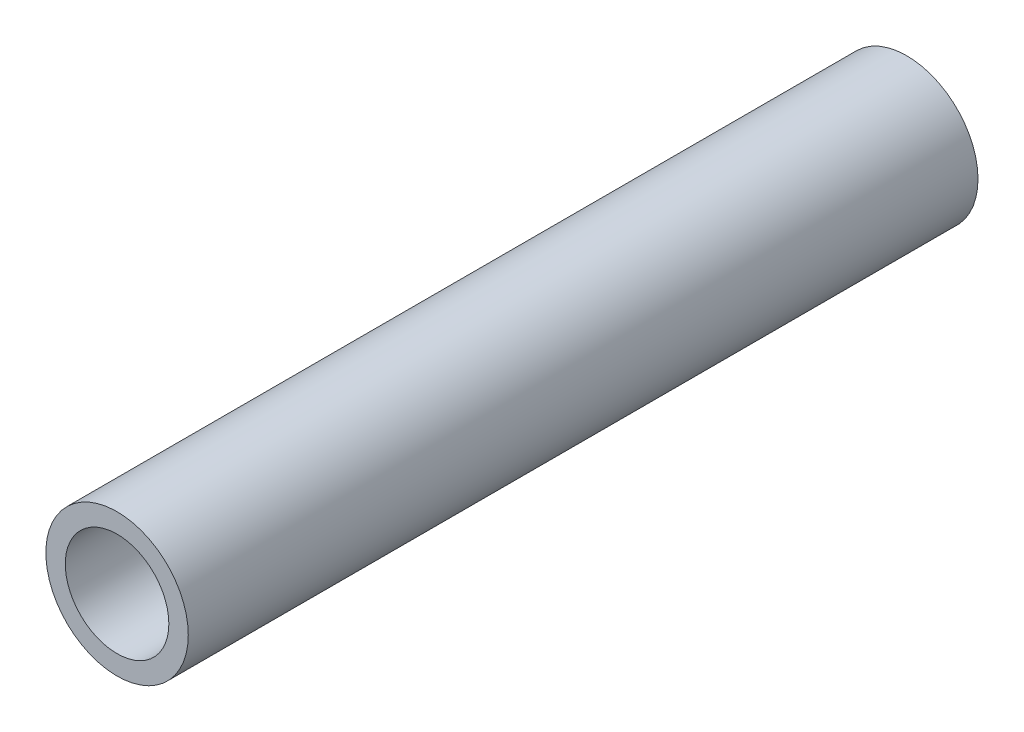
ISO-10303-21;
HEADER;
FILE_DESCRIPTION(('STEP AP214'),'2;1');
FILE_NAME('part.step','',(''),(''),'','','');
FILE_SCHEMA(('AUTOMOTIVE_DESIGN { 1 0 10303 214 1 1 1 1 }'));
ENDSEC;
DATA;
#1=APPLICATION_CONTEXT('core data for automotive mechanical design processes');
#2=APPLICATION_PROTOCOL_DEFINITION('international standard','automotive_design',2000,#1);
#3=PRODUCT_CONTEXT('',#1,'mechanical');
#4=PRODUCT('Part','Part','',(#3));
#5=PRODUCT_RELATED_PRODUCT_CATEGORY('part','',(#4));
#6=PRODUCT_DEFINITION_FORMATION('','',#4);
#7=PRODUCT_DEFINITION_CONTEXT('part definition',#1,'design');
#8=PRODUCT_DEFINITION('design','',#6,#7);
#9=PRODUCT_DEFINITION_SHAPE('','',#8);
#10=(LENGTH_UNIT() NAMED_UNIT(*) SI_UNIT(.MILLI.,.METRE.));
#11=(NAMED_UNIT(*) PLANE_ANGLE_UNIT() SI_UNIT($,.RADIAN.));
#12=(NAMED_UNIT(*) SI_UNIT($,.STERADIAN.) SOLID_ANGLE_UNIT());
#13=UNCERTAINTY_MEASURE_WITH_UNIT(LENGTH_MEASURE(1.E-05),#10,'distance_accuracy_value','');
#14=(GEOMETRIC_REPRESENTATION_CONTEXT(3) GLOBAL_UNCERTAINTY_ASSIGNED_CONTEXT((#13)) GLOBAL_UNIT_ASSIGNED_CONTEXT((#10,
#11,#12)) REPRESENTATION_CONTEXT('',''));
#15=CARTESIAN_POINT('',(0.,0.,0.));
#16=DIRECTION('',(0.,0.,1.));
#17=DIRECTION('',(1.,0.,0.));
#18=AXIS2_PLACEMENT_3D('',#15,#16,#17);
#19=CARTESIAN_POINT('',(0.,0.,309.88));
#20=DIRECTION('',(0.,0.,-1.));
#21=DIRECTION('',(-1.,0.,0.));
#22=AXIS2_PLACEMENT_3D('',#19,#20,#21);
#23=CYLINDRICAL_SURFACE('',#22,27.94);
#24=CARTESIAN_POINT('',(0.,0.,309.88));
#25=DIRECTION('',(0.,0.,1.));
#26=DIRECTION('',(1.,0.,0.));
#27=AXIS2_PLACEMENT_3D('',#24,#25,#26);
#28=CIRCLE('',#27,27.94);
#29=CARTESIAN_POINT('',(27.94,0.,309.88));
#30=VERTEX_POINT('',#29);
#31=EDGE_CURVE('E10',#30,#30,#28,.T.);
#32=ORIENTED_EDGE('',*,*,#31,.F.);
#33=EDGE_LOOP('',(#32));
#34=FACE_BOUND('',#33,.T.);
#35=CARTESIAN_POINT('',(0.,0.,0.));
#36=DIRECTION('',(0.,0.,1.));
#37=DIRECTION('',(1.,0.,0.));
#38=AXIS2_PLACEMENT_3D('',#35,#36,#37);
#39=CIRCLE('',#38,27.94);
#40=CARTESIAN_POINT('',(27.94,0.,0.));
#41=VERTEX_POINT('',#40);
#42=EDGE_CURVE('E40',#41,#41,#39,.T.);
#43=ORIENTED_EDGE('',*,*,#42,.T.);
#44=EDGE_LOOP('',(#43));
#45=FACE_BOUND('',#44,.T.);
#46=ADVANCED_FACE('F37',(#34,#45),#23,.T.);
#47=CARTESIAN_POINT('',(0.,0.,309.88));
#48=DIRECTION('',(0.,0.,1.));
#49=DIRECTION('',(1.,0.,0.));
#50=AXIS2_PLACEMENT_3D('',#47,#48,#49);
#51=PLANE('',#50);
#52=CARTESIAN_POINT('',(0.,0.,309.88));
#53=DIRECTION('',(0.,0.,1.));
#54=DIRECTION('',(1.,0.,0.));
#55=AXIS2_PLACEMENT_3D('',#52,#53,#54);
#56=CIRCLE('',#55,20.32);
#57=CARTESIAN_POINT('',(20.32,0.,309.88));
#58=VERTEX_POINT('',#57);
#59=EDGE_CURVE('E51',#58,#58,#56,.T.);
#60=ORIENTED_EDGE('',*,*,#59,.F.);
#61=EDGE_LOOP('',(#60));
#62=FACE_BOUND('',#61,.T.);
#63=ORIENTED_EDGE('',*,*,#31,.T.);
#64=EDGE_LOOP('',(#63));
#65=FACE_BOUND('',#64,.T.);
#66=ADVANCED_FACE('F80',(#62,#65),#51,.T.);
#67=CARTESIAN_POINT('',(0.,0.,0.));
#68=DIRECTION('',(0.,0.,1.));
#69=DIRECTION('',(1.,0.,0.));
#70=AXIS2_PLACEMENT_3D('',#67,#68,#69);
#71=PLANE('',#70);
#72=CARTESIAN_POINT('',(0.,0.,0.));
#73=DIRECTION('',(0.,0.,-1.));
#74=DIRECTION('',(-1.,0.,0.));
#75=AXIS2_PLACEMENT_3D('',#72,#73,#74);
#76=CIRCLE('',#75,20.32);
#77=CARTESIAN_POINT('',(-20.32,0.,0.));
#78=VERTEX_POINT('',#77);
#79=EDGE_CURVE('E59',#78,#78,#76,.T.);
#80=ORIENTED_EDGE('',*,*,#79,.F.);
#81=EDGE_LOOP('',(#80));
#82=FACE_BOUND('',#81,.T.);
#83=ORIENTED_EDGE('',*,*,#42,.F.);
#84=EDGE_LOOP('',(#83));
#85=FACE_BOUND('',#84,.T.);
#86=ADVANCED_FACE('F76',(#82,#85),#71,.F.);
#87=CARTESIAN_POINT('',(0.,0.,55.88));
#88=DIRECTION('',(0.,0.,1.));
#89=DIRECTION('',(1.,0.,0.));
#90=AXIS2_PLACEMENT_3D('',#87,#88,#89);
#91=CYLINDRICAL_SURFACE('',#90,20.32);
#92=CARTESIAN_POINT('',(0.,0.,55.88));
#93=DIRECTION('',(0.,0.,1.));
#94=DIRECTION('',(1.,0.,0.));
#95=AXIS2_PLACEMENT_3D('',#92,#93,#94);
#96=CIRCLE('',#95,20.32);
#97=CARTESIAN_POINT('',(20.32,0.,55.88));
#98=VERTEX_POINT('',#97);
#99=EDGE_CURVE('E49',#98,#98,#96,.T.);
#100=ORIENTED_EDGE('',*,*,#99,.F.);
#101=EDGE_LOOP('',(#100));
#102=FACE_BOUND('',#101,.T.);
#103=ORIENTED_EDGE('',*,*,#59,.T.);
#104=EDGE_LOOP('',(#103));
#105=FACE_BOUND('',#104,.T.);
#106=ADVANCED_FACE('F79',(#102,#105),#91,.F.);
#107=CARTESIAN_POINT('',(0.,0.,55.88));
#108=DIRECTION('',(0.,0.,1.));
#109=DIRECTION('',(1.,0.,0.));
#110=AXIS2_PLACEMENT_3D('',#107,#108,#109);
#111=PLANE('',#110);
#112=ORIENTED_EDGE('',*,*,#99,.T.);
#113=EDGE_LOOP('',(#112));
#114=FACE_BOUND('',#113,.T.);
#115=ADVANCED_FACE('F72',(#114),#111,.T.);
#116=CARTESIAN_POINT('',(0.,0.,50.8));
#117=DIRECTION('',(0.,0.,-1.));
#118=DIRECTION('',(-1.,0.,0.));
#119=AXIS2_PLACEMENT_3D('',#116,#117,#118);
#120=CYLINDRICAL_SURFACE('',#119,20.32);
#121=CARTESIAN_POINT('',(0.,0.,50.8));
#122=DIRECTION('',(0.,0.,-1.));
#123=DIRECTION('',(-1.,0.,0.));
#124=AXIS2_PLACEMENT_3D('',#121,#122,#123);
#125=CIRCLE('',#124,20.32);
#126=CARTESIAN_POINT('',(-20.32,0.,50.8));
#127=VERTEX_POINT('',#126);
#128=EDGE_CURVE('E55',#127,#127,#125,.T.);
#129=ORIENTED_EDGE('',*,*,#128,.F.);
#130=EDGE_LOOP('',(#129));
#131=FACE_BOUND('',#130,.T.);
#132=ORIENTED_EDGE('',*,*,#79,.T.);
#133=EDGE_LOOP('',(#132));
#134=FACE_BOUND('',#133,.T.);
#135=ADVANCED_FACE('F69',(#131,#134),#120,.F.);
#136=CARTESIAN_POINT('',(0.,0.,50.8));
#137=DIRECTION('',(0.,0.,-1.));
#138=DIRECTION('',(-1.,0.,0.));
#139=AXIS2_PLACEMENT_3D('',#136,#137,#138);
#140=PLANE('',#139);
#141=ORIENTED_EDGE('',*,*,#128,.T.);
#142=EDGE_LOOP('',(#141));
#143=FACE_BOUND('',#142,.T.);
#144=ADVANCED_FACE('F67',(#143),#140,.T.);
#145=CLOSED_SHELL('',(#46,#66,#86,#106,#115,#135,#144));
#146=MANIFOLD_SOLID_BREP('B2',#145);
#147=ADVANCED_BREP_SHAPE_REPRESENTATION('',(#18,#146),#14);
#148=SHAPE_DEFINITION_REPRESENTATION(#9,#147);
ENDSEC;
END-ISO-10303-21;
